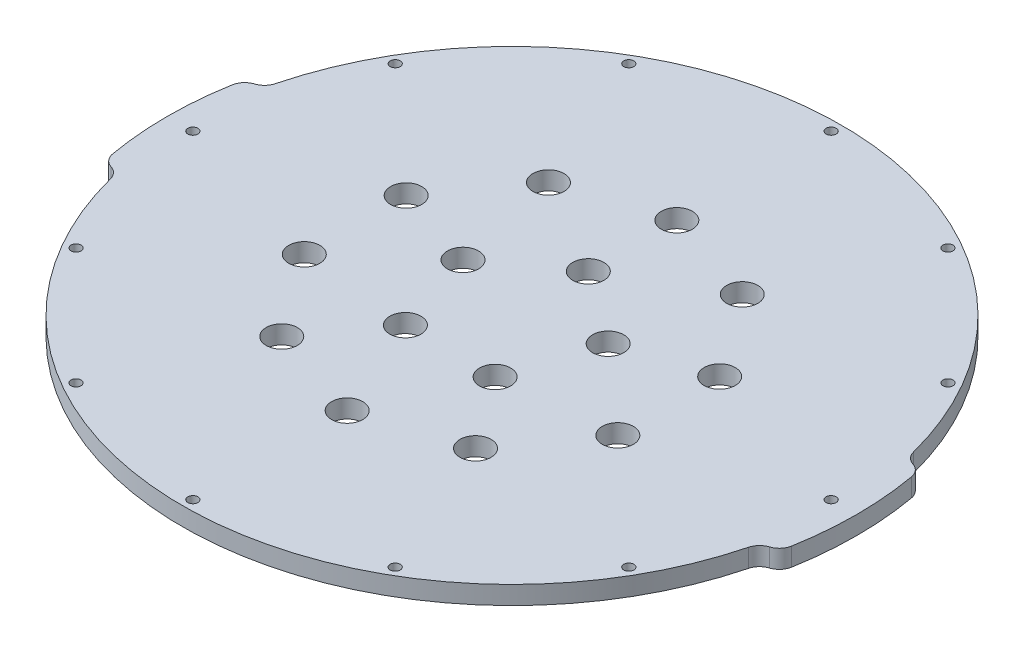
ISO-10303-21;
HEADER;
FILE_DESCRIPTION(('STEP AP214'),'2;1');
FILE_NAME('part.step','',(''),(''),'','','');
FILE_SCHEMA(('AUTOMOTIVE_DESIGN { 1 0 10303 214 1 1 1 1 }'));
ENDSEC;
DATA;
#1=APPLICATION_CONTEXT('core data for automotive mechanical design processes');
#2=APPLICATION_PROTOCOL_DEFINITION('international standard','automotive_design',2000,#1);
#3=PRODUCT_CONTEXT('',#1,'mechanical');
#4=PRODUCT('Part','Part','',(#3));
#5=PRODUCT_RELATED_PRODUCT_CATEGORY('part','',(#4));
#6=PRODUCT_DEFINITION_FORMATION('','',#4);
#7=PRODUCT_DEFINITION_CONTEXT('part definition',#1,'design');
#8=PRODUCT_DEFINITION('design','',#6,#7);
#9=PRODUCT_DEFINITION_SHAPE('','',#8);
#10=(LENGTH_UNIT() NAMED_UNIT(*) SI_UNIT(.MILLI.,.METRE.));
#11=(NAMED_UNIT(*) PLANE_ANGLE_UNIT() SI_UNIT($,.RADIAN.));
#12=(NAMED_UNIT(*) SI_UNIT($,.STERADIAN.) SOLID_ANGLE_UNIT());
#13=UNCERTAINTY_MEASURE_WITH_UNIT(LENGTH_MEASURE(1.E-05),#10,'distance_accuracy_value','');
#14=(GEOMETRIC_REPRESENTATION_CONTEXT(3) GLOBAL_UNCERTAINTY_ASSIGNED_CONTEXT((#13)) GLOBAL_UNIT_ASSIGNED_CONTEXT((#10,
#11,#12)) REPRESENTATION_CONTEXT('',''));
#15=CARTESIAN_POINT('',(0.,0.,0.));
#16=DIRECTION('',(0.,0.,1.));
#17=DIRECTION('',(1.,0.,0.));
#18=AXIS2_PLACEMENT_3D('',#15,#16,#17);
#19=CARTESIAN_POINT('',(-53.1549984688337,6.,-9.37266038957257));
#20=DIRECTION('',(0.,-1.,0.));
#21=DIRECTION('',(0.,0.,-1.));
#22=AXIS2_PLACEMENT_3D('',#19,#20,#21);
#23=PLANE('',#22);
#24=CARTESIAN_POINT('',(23.7764129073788,6.,-7.72542485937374));
#25=DIRECTION('',(0.,1.,0.));
#26=DIRECTION('',(0.,0.,1.));
#27=AXIS2_PLACEMENT_3D('',#24,#25,#26);
#28=CIRCLE('',#27,5.1);
#29=CARTESIAN_POINT('',(23.7764129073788,6.,-2.62542485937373));
#30=VERTEX_POINT('',#29);
#31=EDGE_CURVE('E273',#30,#30,#28,.T.);
#32=ORIENTED_EDGE('',*,*,#31,.F.);
#33=EDGE_LOOP('',(#32));
#34=FACE_BOUND('',#33,.T.);
#35=CARTESIAN_POINT('',(0.,6.,-25.));
#36=DIRECTION('',(0.,1.,0.));
#37=DIRECTION('',(0.,0.,1.));
#38=AXIS2_PLACEMENT_3D('',#35,#36,#37);
#39=CIRCLE('',#38,5.1);
#40=CARTESIAN_POINT('',(0.,6.,-19.9));
#41=VERTEX_POINT('',#40);
#42=EDGE_CURVE('E281',#41,#41,#39,.T.);
#43=ORIENTED_EDGE('',*,*,#42,.F.);
#44=EDGE_LOOP('',(#43));
#45=FACE_BOUND('',#44,.T.);
#46=CARTESIAN_POINT('',(-23.7764129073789,6.,-7.72542485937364));
#47=DIRECTION('',(0.,1.,0.));
#48=DIRECTION('',(0.,0.,1.));
#49=AXIS2_PLACEMENT_3D('',#46,#47,#48);
#50=CIRCLE('',#49,5.1);
#51=CARTESIAN_POINT('',(-23.7764129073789,6.,-2.62542485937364));
#52=VERTEX_POINT('',#51);
#53=EDGE_CURVE('E215',#52,#52,#50,.T.);
#54=ORIENTED_EDGE('',*,*,#53,.F.);
#55=EDGE_LOOP('',(#54));
#56=FACE_BOUND('',#55,.T.);
#57=CARTESIAN_POINT('',(-14.6946313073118,6.,20.2254248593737));
#58=DIRECTION('',(0.,1.,0.));
#59=DIRECTION('',(0.,0.,1.));
#60=AXIS2_PLACEMENT_3D('',#57,#58,#59);
#61=CIRCLE('',#60,5.1);
#62=CARTESIAN_POINT('',(-14.6946313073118,6.,25.3254248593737));
#63=VERTEX_POINT('',#62);
#64=EDGE_CURVE('E214',#63,#63,#61,.T.);
#65=ORIENTED_EDGE('',*,*,#64,.F.);
#66=EDGE_LOOP('',(#65));
#67=FACE_BOUND('',#66,.T.);
#68=CARTESIAN_POINT('',(-31.7404036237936,6.,-43.6869176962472));
#69=DIRECTION('',(0.,1.,0.));
#70=DIRECTION('',(0.,0.,1.));
#71=AXIS2_PLACEMENT_3D('',#68,#69,#70);
#72=CIRCLE('',#71,5.1);
#73=CARTESIAN_POINT('',(-31.7404036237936,6.,-38.5869176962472));
#74=VERTEX_POINT('',#73);
#75=EDGE_CURVE('E296',#74,#74,#72,.T.);
#76=ORIENTED_EDGE('',*,*,#75,.F.);
#77=EDGE_LOOP('',(#76));
#78=FACE_BOUND('',#77,.T.);
#79=CARTESIAN_POINT('',(-51.3570518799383,6.,-16.6869176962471));
#80=DIRECTION('',(0.,1.,0.));
#81=DIRECTION('',(0.,0.,1.));
#82=AXIS2_PLACEMENT_3D('',#79,#80,#81);
#83=CIRCLE('',#82,5.1);
#84=CARTESIAN_POINT('',(-51.3570518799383,6.,-11.5869176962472));
#85=VERTEX_POINT('',#84);
#86=EDGE_CURVE('E302',#85,#85,#83,.T.);
#87=ORIENTED_EDGE('',*,*,#86,.F.);
#88=EDGE_LOOP('',(#87));
#89=FACE_BOUND('',#88,.T.);
#90=CARTESIAN_POINT('',(-51.3570518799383,6.,16.6869176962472));
#91=DIRECTION('',(0.,1.,0.));
#92=DIRECTION('',(0.,0.,1.));
#93=AXIS2_PLACEMENT_3D('',#90,#91,#92);
#94=CIRCLE('',#93,5.1);
#95=CARTESIAN_POINT('',(-51.3570518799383,6.,21.7869176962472));
#96=VERTEX_POINT('',#95);
#97=EDGE_CURVE('E243',#96,#96,#94,.T.);
#98=ORIENTED_EDGE('',*,*,#97,.F.);
#99=EDGE_LOOP('',(#98));
#100=FACE_BOUND('',#99,.T.);
#101=CARTESIAN_POINT('',(-31.7404036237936,6.,43.6869176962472));
#102=DIRECTION('',(0.,1.,0.));
#103=DIRECTION('',(0.,0.,1.));
#104=AXIS2_PLACEMENT_3D('',#101,#102,#103);
#105=CIRCLE('',#104,5.1);
#106=CARTESIAN_POINT('',(-31.7404036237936,6.,48.7869176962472));
#107=VERTEX_POINT('',#106);
#108=EDGE_CURVE('E242',#107,#107,#105,.T.);
#109=ORIENTED_EDGE('',*,*,#108,.F.);
#110=EDGE_LOOP('',(#109));
#111=FACE_BOUND('',#110,.T.);
#112=CARTESIAN_POINT('',(0.,6.,54.));
#113=DIRECTION('',(0.,1.,0.));
#114=DIRECTION('',(0.,0.,1.));
#115=AXIS2_PLACEMENT_3D('',#112,#113,#114);
#116=CIRCLE('',#115,5.1);
#117=CARTESIAN_POINT('',(0.,6.,59.1));
#118=VERTEX_POINT('',#117);
#119=EDGE_CURVE('E316',#118,#118,#116,.T.);
#120=ORIENTED_EDGE('',*,*,#119,.F.);
#121=EDGE_LOOP('',(#120));
#122=FACE_BOUND('',#121,.T.);
#123=CARTESIAN_POINT('',(14.6946313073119,6.,20.2254248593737));
#124=DIRECTION('',(0.,1.,0.));
#125=DIRECTION('',(0.,0.,1.));
#126=AXIS2_PLACEMENT_3D('',#123,#124,#125);
#127=CIRCLE('',#126,5.1);
#128=CARTESIAN_POINT('',(14.6946313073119,6.,25.3254248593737));
#129=VERTEX_POINT('',#128);
#130=EDGE_CURVE('E324',#129,#129,#127,.T.);
#131=ORIENTED_EDGE('',*,*,#130,.F.);
#132=EDGE_LOOP('',(#131));
#133=FACE_BOUND('',#132,.T.);
#134=CARTESIAN_POINT('',(31.7404036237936,6.,43.6869176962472));
#135=DIRECTION('',(0.,1.,0.));
#136=DIRECTION('',(0.,0.,1.));
#137=AXIS2_PLACEMENT_3D('',#134,#135,#136);
#138=CIRCLE('',#137,5.09999999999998);
#139=CARTESIAN_POINT('',(31.7404036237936,6.,48.7869176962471));
#140=VERTEX_POINT('',#139);
#141=EDGE_CURVE('E204',#140,#140,#138,.T.);
#142=ORIENTED_EDGE('',*,*,#141,.F.);
#143=EDGE_LOOP('',(#142));
#144=FACE_BOUND('',#143,.T.);
#145=CARTESIAN_POINT('',(51.3570518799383,6.,16.6869176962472));
#146=DIRECTION('',(0.,1.,0.));
#147=DIRECTION('',(0.,0.,1.));
#148=AXIS2_PLACEMENT_3D('',#145,#146,#147);
#149=CIRCLE('',#148,5.10000000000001);
#150=CARTESIAN_POINT('',(51.3570518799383,6.,21.7869176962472));
#151=VERTEX_POINT('',#150);
#152=EDGE_CURVE('E209',#151,#151,#149,.T.);
#153=ORIENTED_EDGE('',*,*,#152,.F.);
#154=EDGE_LOOP('',(#153));
#155=FACE_BOUND('',#154,.T.);
#156=CARTESIAN_POINT('',(51.3570518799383,6.,-16.6869176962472));
#157=DIRECTION('',(0.,1.,0.));
#158=DIRECTION('',(0.,0.,1.));
#159=AXIS2_PLACEMENT_3D('',#156,#157,#158);
#160=CIRCLE('',#159,5.09999999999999);
#161=CARTESIAN_POINT('',(51.3570518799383,6.,-11.5869176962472));
#162=VERTEX_POINT('',#161);
#163=EDGE_CURVE('E237',#162,#162,#160,.T.);
#164=ORIENTED_EDGE('',*,*,#163,.F.);
#165=EDGE_LOOP('',(#164));
#166=FACE_BOUND('',#165,.T.);
#167=CARTESIAN_POINT('',(31.7404036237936,6.,-43.6869176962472));
#168=DIRECTION('',(0.,1.,0.));
#169=DIRECTION('',(0.,0.,1.));
#170=AXIS2_PLACEMENT_3D('',#167,#168,#169);
#171=CIRCLE('',#170,5.09999999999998);
#172=CARTESIAN_POINT('',(31.7404036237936,6.,-38.5869176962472));
#173=VERTEX_POINT('',#172);
#174=EDGE_CURVE('E341',#173,#173,#171,.T.);
#175=ORIENTED_EDGE('',*,*,#174,.F.);
#176=EDGE_LOOP('',(#175));
#177=FACE_BOUND('',#176,.T.);
#178=CARTESIAN_POINT('',(0.,6.,-54.));
#179=DIRECTION('',(0.,1.,0.));
#180=DIRECTION('',(0.,0.,1.));
#181=AXIS2_PLACEMENT_3D('',#178,#179,#180);
#182=CIRCLE('',#181,5.1);
#183=CARTESIAN_POINT('',(0.,6.,-48.9));
#184=VERTEX_POINT('',#183);
#185=EDGE_CURVE('E349',#184,#184,#182,.T.);
#186=ORIENTED_EDGE('',*,*,#185,.F.);
#187=EDGE_LOOP('',(#186));
#188=FACE_BOUND('',#187,.T.);
#189=CARTESIAN_POINT('',(-90.5429559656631,6.,-52.2749999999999));
#190=DIRECTION('',(0.,1.,0.));
#191=DIRECTION('',(0.,0.,1.));
#192=AXIS2_PLACEMENT_3D('',#189,#190,#191);
#193=CIRCLE('',#192,1.65000000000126);
#194=CARTESIAN_POINT('',(-90.5429559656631,6.,-50.6249999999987));
#195=VERTEX_POINT('',#194);
#196=EDGE_CURVE('E368',#195,#195,#193,.T.);
#197=ORIENTED_EDGE('',*,*,#196,.F.);
#198=EDGE_LOOP('',(#197));
#199=FACE_BOUND('',#198,.T.);
#200=CARTESIAN_POINT('',(-90.542955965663,6.,52.2750000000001));
#201=DIRECTION('',(0.,1.,0.));
#202=DIRECTION('',(0.,0.,1.));
#203=AXIS2_PLACEMENT_3D('',#200,#201,#202);
#204=CIRCLE('',#203,1.65000000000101);
#205=CARTESIAN_POINT('',(-90.542955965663,6.,53.9250000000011));
#206=VERTEX_POINT('',#205);
#207=EDGE_CURVE('E384',#206,#206,#204,.T.);
#208=ORIENTED_EDGE('',*,*,#207,.F.);
#209=EDGE_LOOP('',(#208));
#210=FACE_BOUND('',#209,.T.);
#211=CARTESIAN_POINT('',(0.,6.,104.55));
#212=DIRECTION('',(0.,1.,0.));
#213=DIRECTION('',(0.,0.,1.));
#214=AXIS2_PLACEMENT_3D('',#211,#212,#213);
#215=CIRCLE('',#214,1.65000000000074);
#216=CARTESIAN_POINT('',(0.,6.,106.200000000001));
#217=VERTEX_POINT('',#216);
#218=EDGE_CURVE('E399',#217,#217,#215,.T.);
#219=ORIENTED_EDGE('',*,*,#218,.F.);
#220=EDGE_LOOP('',(#219));
#221=FACE_BOUND('',#220,.T.);
#222=CARTESIAN_POINT('',(90.5429559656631,6.,52.275));
#223=DIRECTION('',(0.,1.,0.));
#224=DIRECTION('',(0.,0.,1.));
#225=AXIS2_PLACEMENT_3D('',#222,#223,#224);
#226=CIRCLE('',#225,1.65000000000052);
#227=CARTESIAN_POINT('',(90.5429559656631,6.,53.9250000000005));
#228=VERTEX_POINT('',#227);
#229=EDGE_CURVE('E217',#228,#228,#226,.T.);
#230=ORIENTED_EDGE('',*,*,#229,.F.);
#231=EDGE_LOOP('',(#230));
#232=FACE_BOUND('',#231,.T.);
#233=CARTESIAN_POINT('',(90.5429559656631,6.,-52.275));
#234=DIRECTION('',(0.,1.,0.));
#235=DIRECTION('',(0.,0.,1.));
#236=AXIS2_PLACEMENT_3D('',#233,#234,#235);
#237=CIRCLE('',#236,1.65000000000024);
#238=CARTESIAN_POINT('',(90.5429559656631,6.,-50.6249999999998));
#239=VERTEX_POINT('',#238);
#240=EDGE_CURVE('E417',#239,#239,#237,.T.);
#241=ORIENTED_EDGE('',*,*,#240,.F.);
#242=EDGE_LOOP('',(#241));
#243=FACE_BOUND('',#242,.T.);
#244=CARTESIAN_POINT('',(0.,6.,-104.55));
#245=DIRECTION('',(0.,1.,0.));
#246=DIRECTION('',(0.,0.,1.));
#247=AXIS2_PLACEMENT_3D('',#244,#245,#246);
#248=CIRCLE('',#247,1.65);
#249=CARTESIAN_POINT('',(0.,6.,-102.9));
#250=VERTEX_POINT('',#249);
#251=EDGE_CURVE('E433',#250,#250,#248,.T.);
#252=ORIENTED_EDGE('',*,*,#251,.F.);
#253=EDGE_LOOP('',(#252));
#254=FACE_BOUND('',#253,.T.);
#255=CARTESIAN_POINT('',(0.,6.,0.));
#256=DIRECTION('',(0.,1.,0.));
#257=DIRECTION('',(0.,0.,-1.));
#258=AXIS2_PLACEMENT_3D('',#255,#256,#257);
#259=CIRCLE('',#258,107.95);
#260=CARTESIAN_POINT('',(104.513991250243,6.,-27.0190327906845));
#261=VERTEX_POINT('',#260);
#262=CARTESIAN_POINT('',(-104.513991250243,6.,-27.0190327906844));
#263=VERTEX_POINT('',#262);
#264=EDGE_CURVE('E255',#261,#263,#259,.T.);
#265=ORIENTED_EDGE('',*,*,#264,.T.);
#266=CARTESIAN_POINT('',(-109.354843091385,6.,-28.2704933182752));
#267=DIRECTION('',(0.,-1.,0.));
#268=DIRECTION('',(0.,0.,-1.));
#269=AXIS2_PLACEMENT_3D('',#266,#267,#268);
#270=CIRCLE('',#269,5.);
#271=CARTESIAN_POINT('',(-107.832420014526,6.,-23.5079070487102));
#272=VERTEX_POINT('',#271);
#273=EDGE_CURVE('E130',#263,#272,#270,.T.);
#274=ORIENTED_EDGE('',*,*,#273,.T.);
#275=CARTESIAN_POINT('',(-106.309996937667,6.,-18.7453207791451));
#276=DIRECTION('',(0.,1.,0.));
#277=DIRECTION('',(0.,0.,-1.));
#278=AXIS2_PLACEMENT_3D('',#275,#276,#277);
#279=CIRCLE('',#278,5.00000000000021);
#280=CARTESIAN_POINT('',(-111.234035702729,6.,-19.6135616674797));
#281=VERTEX_POINT('',#280);
#282=EDGE_CURVE('E123',#272,#281,#279,.T.);
#283=ORIENTED_EDGE('',*,*,#282,.T.);
#284=CARTESIAN_POINT('',(0.,6.,0.));
#285=DIRECTION('',(0.,1.,0.));
#286=DIRECTION('',(0.,0.,-1.));
#287=AXIS2_PLACEMENT_3D('',#284,#285,#286);
#288=CIRCLE('',#287,112.95);
#289=CARTESIAN_POINT('',(-111.234035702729,6.,19.6135616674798));
#290=VERTEX_POINT('',#289);
#291=EDGE_CURVE('E127',#281,#290,#288,.T.);
#292=ORIENTED_EDGE('',*,*,#291,.T.);
#293=CARTESIAN_POINT('',(-106.309996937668,6.,18.7453207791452));
#294=DIRECTION('',(0.,1.,0.));
#295=DIRECTION('',(0.,0.,1.));
#296=AXIS2_PLACEMENT_3D('',#293,#294,#295);
#297=CIRCLE('',#296,5.00000000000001);
#298=CARTESIAN_POINT('',(-107.832420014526,6.,23.5079070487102));
#299=VERTEX_POINT('',#298);
#300=EDGE_CURVE('E145',#290,#299,#297,.T.);
#301=ORIENTED_EDGE('',*,*,#300,.T.);
#302=CARTESIAN_POINT('',(-109.354843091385,6.,28.2704933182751));
#303=DIRECTION('',(0.,-1.,0.));
#304=DIRECTION('',(0.,0.,-1.));
#305=AXIS2_PLACEMENT_3D('',#302,#303,#304);
#306=CIRCLE('',#305,5.);
#307=CARTESIAN_POINT('',(-104.513991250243,6.,27.0190327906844));
#308=VERTEX_POINT('',#307);
#309=EDGE_CURVE('E11',#299,#308,#306,.T.);
#310=ORIENTED_EDGE('',*,*,#309,.T.);
#311=CARTESIAN_POINT('',(0.,6.,-4.92661467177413E-13));
#312=DIRECTION('',(0.,1.,0.));
#313=DIRECTION('',(0.,0.,-1.));
#314=AXIS2_PLACEMENT_3D('',#311,#312,#313);
#315=CIRCLE('',#314,107.95);
#316=CARTESIAN_POINT('',(104.513991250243,6.,27.0190327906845));
#317=VERTEX_POINT('',#316);
#318=EDGE_CURVE('E247',#308,#317,#315,.T.);
#319=ORIENTED_EDGE('',*,*,#318,.T.);
#320=CARTESIAN_POINT('',(109.354843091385,6.,28.2704933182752));
#321=DIRECTION('',(0.,-1.,0.));
#322=DIRECTION('',(0.,0.,-1.));
#323=AXIS2_PLACEMENT_3D('',#320,#321,#322);
#324=CIRCLE('',#323,5.);
#325=CARTESIAN_POINT('',(107.832420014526,6.,23.5079070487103));
#326=VERTEX_POINT('',#325);
#327=EDGE_CURVE('E188',#317,#326,#324,.T.);
#328=ORIENTED_EDGE('',*,*,#327,.T.);
#329=CARTESIAN_POINT('',(106.309996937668,6.,18.7453207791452));
#330=DIRECTION('',(0.,1.,0.));
#331=DIRECTION('',(0.,0.,-1.));
#332=AXIS2_PLACEMENT_3D('',#329,#330,#331);
#333=CIRCLE('',#332,5.00000000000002);
#334=CARTESIAN_POINT('',(111.234035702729,6.,19.6135616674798));
#335=VERTEX_POINT('',#334);
#336=EDGE_CURVE('E245',#326,#335,#333,.T.);
#337=ORIENTED_EDGE('',*,*,#336,.T.);
#338=CARTESIAN_POINT('',(-1.29063426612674E-12,6.,0.));
#339=DIRECTION('',(0.,1.,0.));
#340=DIRECTION('',(0.,0.,1.));
#341=AXIS2_PLACEMENT_3D('',#338,#339,#340);
#342=CIRCLE('',#341,112.950000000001);
#343=CARTESIAN_POINT('',(111.234035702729,6.,-19.6135616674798));
#344=VERTEX_POINT('',#343);
#345=EDGE_CURVE('E246',#335,#344,#342,.T.);
#346=ORIENTED_EDGE('',*,*,#345,.T.);
#347=CARTESIAN_POINT('',(106.309996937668,6.,-18.7453207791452));
#348=DIRECTION('',(0.,1.,0.));
#349=DIRECTION('',(0.,0.,1.));
#350=AXIS2_PLACEMENT_3D('',#347,#348,#349);
#351=CIRCLE('',#350,5.);
#352=CARTESIAN_POINT('',(107.832420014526,6.,-23.5079070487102));
#353=VERTEX_POINT('',#352);
#354=EDGE_CURVE('E444',#344,#353,#351,.T.);
#355=ORIENTED_EDGE('',*,*,#354,.T.);
#356=CARTESIAN_POINT('',(109.354843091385,6.,-28.2704933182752));
#357=DIRECTION('',(0.,-1.,0.));
#358=DIRECTION('',(0.,0.,-1.));
#359=AXIS2_PLACEMENT_3D('',#356,#357,#358);
#360=CIRCLE('',#359,5.);
#361=EDGE_CURVE('E194',#353,#261,#360,.T.);
#362=ORIENTED_EDGE('',*,*,#361,.T.);
#363=EDGE_LOOP('',(#265,#274,#283,#292,#301,#310,#319,#328,#337,#346,#355,#362));
#364=FACE_BOUND('',#363,.T.);
#365=CARTESIAN_POINT('',(52.275,6.,-90.5429559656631));
#366=DIRECTION('',(0.,1.,0.));
#367=DIRECTION('',(0.,0.,1.));
#368=AXIS2_PLACEMENT_3D('',#365,#366,#367);
#369=CIRCLE('',#368,1.65000000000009);
#370=CARTESIAN_POINT('',(52.275,6.,-88.892955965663));
#371=VERTEX_POINT('',#370);
#372=EDGE_CURVE('E425',#371,#371,#369,.T.);
#373=ORIENTED_EDGE('',*,*,#372,.F.);
#374=EDGE_LOOP('',(#373));
#375=FACE_BOUND('',#374,.T.);
#376=CARTESIAN_POINT('',(104.55,6.,0.));
#377=DIRECTION('',(0.,1.,0.));
#378=DIRECTION('',(0.,0.,1.));
#379=AXIS2_PLACEMENT_3D('',#376,#377,#378);
#380=CIRCLE('',#379,1.65000000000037);
#381=CARTESIAN_POINT('',(104.55,6.,1.65000000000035));
#382=VERTEX_POINT('',#381);
#383=EDGE_CURVE('E260',#382,#382,#380,.T.);
#384=ORIENTED_EDGE('',*,*,#383,.F.);
#385=EDGE_LOOP('',(#384));
#386=FACE_BOUND('',#385,.T.);
#387=CARTESIAN_POINT('',(52.2750000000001,6.,90.542955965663));
#388=DIRECTION('',(0.,1.,0.));
#389=DIRECTION('',(0.,0.,1.));
#390=AXIS2_PLACEMENT_3D('',#387,#388,#389);
#391=CIRCLE('',#390,1.65000000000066);
#392=CARTESIAN_POINT('',(52.2750000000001,6.,92.1929559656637));
#393=VERTEX_POINT('',#392);
#394=EDGE_CURVE('E407',#393,#393,#391,.T.);
#395=ORIENTED_EDGE('',*,*,#394,.F.);
#396=EDGE_LOOP('',(#395));
#397=FACE_BOUND('',#396,.T.);
#398=CARTESIAN_POINT('',(-52.2749999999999,6.,90.5429559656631));
#399=DIRECTION('',(0.,1.,0.));
#400=DIRECTION('',(0.,0.,1.));
#401=AXIS2_PLACEMENT_3D('',#398,#399,#400);
#402=CIRCLE('',#401,1.65000000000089);
#403=CARTESIAN_POINT('',(-52.2749999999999,6.,92.192955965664));
#404=VERTEX_POINT('',#403);
#405=EDGE_CURVE('E392',#404,#404,#402,.T.);
#406=ORIENTED_EDGE('',*,*,#405,.F.);
#407=EDGE_LOOP('',(#406));
#408=FACE_BOUND('',#407,.T.);
#409=CARTESIAN_POINT('',(-104.55,6.,0.));
#410=DIRECTION('',(0.,1.,0.));
#411=DIRECTION('',(0.,0.,1.));
#412=AXIS2_PLACEMENT_3D('',#409,#410,#411);
#413=CIRCLE('',#412,1.65000000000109);
#414=CARTESIAN_POINT('',(-104.55,6.,1.65000000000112));
#415=VERTEX_POINT('',#414);
#416=EDGE_CURVE('E376',#415,#415,#413,.T.);
#417=ORIENTED_EDGE('',*,*,#416,.F.);
#418=EDGE_LOOP('',(#417));
#419=FACE_BOUND('',#418,.T.);
#420=CARTESIAN_POINT('',(-52.275,6.,-90.542955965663));
#421=DIRECTION('',(0.,1.,0.));
#422=DIRECTION('',(0.,0.,1.));
#423=AXIS2_PLACEMENT_3D('',#420,#421,#422);
#424=CIRCLE('',#423,1.65000000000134);
#425=CARTESIAN_POINT('',(-52.275,6.,-88.8929559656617));
#426=VERTEX_POINT('',#425);
#427=EDGE_CURVE('E360',#426,#426,#424,.T.);
#428=ORIENTED_EDGE('',*,*,#427,.F.);
#429=EDGE_LOOP('',(#428));
#430=FACE_BOUND('',#429,.T.);
#431=ADVANCED_FACE('F34',(#34,#45,#56,#67,#78,#89,#100,#111,#122,#133,#144,#155,#166,#177,#188,
#199,#210,#221,#232,#243,#254,#364,#375,#386,#397,#408,#419,#430),#23,.F.);
#432=CARTESIAN_POINT('',(-53.1549984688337,0.,-9.37266038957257));
#433=DIRECTION('',(0.,-1.,0.));
#434=DIRECTION('',(0.,0.,-1.));
#435=AXIS2_PLACEMENT_3D('',#432,#433,#434);
#436=PLANE('',#435);
#437=CARTESIAN_POINT('',(23.7764129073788,0.,-7.72542485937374));
#438=DIRECTION('',(0.,1.,0.));
#439=DIRECTION('',(0.,0.,1.));
#440=AXIS2_PLACEMENT_3D('',#437,#438,#439);
#441=CIRCLE('',#440,5.1);
#442=CARTESIAN_POINT('',(23.7764129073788,0.,-2.62542485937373));
#443=VERTEX_POINT('',#442);
#444=EDGE_CURVE('E275',#443,#443,#441,.T.);
#445=ORIENTED_EDGE('',*,*,#444,.T.);
#446=EDGE_LOOP('',(#445));
#447=FACE_BOUND('',#446,.T.);
#448=CARTESIAN_POINT('',(0.,0.,-25.));
#449=DIRECTION('',(0.,1.,0.));
#450=DIRECTION('',(0.,0.,1.));
#451=AXIS2_PLACEMENT_3D('',#448,#449,#450);
#452=CIRCLE('',#451,5.1);
#453=CARTESIAN_POINT('',(0.,0.,-19.9));
#454=VERTEX_POINT('',#453);
#455=EDGE_CURVE('E284',#454,#454,#452,.T.);
#456=ORIENTED_EDGE('',*,*,#455,.T.);
#457=EDGE_LOOP('',(#456));
#458=FACE_BOUND('',#457,.T.);
#459=CARTESIAN_POINT('',(-23.7764129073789,0.,-7.72542485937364));
#460=DIRECTION('',(0.,1.,0.));
#461=DIRECTION('',(0.,0.,1.));
#462=AXIS2_PLACEMENT_3D('',#459,#460,#461);
#463=CIRCLE('',#462,5.1);
#464=CARTESIAN_POINT('',(-23.7764129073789,0.,-2.62542485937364));
#465=VERTEX_POINT('',#464);
#466=EDGE_CURVE('E211',#465,#465,#463,.T.);
#467=ORIENTED_EDGE('',*,*,#466,.T.);
#468=EDGE_LOOP('',(#467));
#469=FACE_BOUND('',#468,.T.);
#470=CARTESIAN_POINT('',(-14.6946313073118,0.,20.2254248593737));
#471=DIRECTION('',(0.,1.,0.));
#472=DIRECTION('',(0.,0.,1.));
#473=AXIS2_PLACEMENT_3D('',#470,#471,#472);
#474=CIRCLE('',#473,5.1);
#475=CARTESIAN_POINT('',(-14.6946313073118,0.,25.3254248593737));
#476=VERTEX_POINT('',#475);
#477=EDGE_CURVE('E252',#476,#476,#474,.T.);
#478=ORIENTED_EDGE('',*,*,#477,.T.);
#479=EDGE_LOOP('',(#478));
#480=FACE_BOUND('',#479,.T.);
#481=CARTESIAN_POINT('',(-31.7404036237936,0.,-43.6869176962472));
#482=DIRECTION('',(0.,1.,0.));
#483=DIRECTION('',(0.,0.,1.));
#484=AXIS2_PLACEMENT_3D('',#481,#482,#483);
#485=CIRCLE('',#484,5.1);
#486=CARTESIAN_POINT('',(-31.7404036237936,0.,-38.5869176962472));
#487=VERTEX_POINT('',#486);
#488=EDGE_CURVE('E298',#487,#487,#485,.T.);
#489=ORIENTED_EDGE('',*,*,#488,.T.);
#490=EDGE_LOOP('',(#489));
#491=FACE_BOUND('',#490,.T.);
#492=CARTESIAN_POINT('',(-51.3570518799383,0.,-16.6869176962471));
#493=DIRECTION('',(0.,1.,0.));
#494=DIRECTION('',(0.,0.,1.));
#495=AXIS2_PLACEMENT_3D('',#492,#493,#494);
#496=CIRCLE('',#495,5.1);
#497=CARTESIAN_POINT('',(-51.3570518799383,0.,-11.5869176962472));
#498=VERTEX_POINT('',#497);
#499=EDGE_CURVE('E271',#498,#498,#496,.T.);
#500=ORIENTED_EDGE('',*,*,#499,.T.);
#501=EDGE_LOOP('',(#500));
#502=FACE_BOUND('',#501,.T.);
#503=CARTESIAN_POINT('',(-51.3570518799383,0.,16.6869176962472));
#504=DIRECTION('',(0.,1.,0.));
#505=DIRECTION('',(0.,0.,1.));
#506=AXIS2_PLACEMENT_3D('',#503,#504,#505);
#507=CIRCLE('',#506,5.1);
#508=CARTESIAN_POINT('',(-51.3570518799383,0.,21.7869176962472));
#509=VERTEX_POINT('',#508);
#510=EDGE_CURVE('E239',#509,#509,#507,.T.);
#511=ORIENTED_EDGE('',*,*,#510,.T.);
#512=EDGE_LOOP('',(#511));
#513=FACE_BOUND('',#512,.T.);
#514=CARTESIAN_POINT('',(-31.7404036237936,0.,43.6869176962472));
#515=DIRECTION('',(0.,1.,0.));
#516=DIRECTION('',(0.,0.,1.));
#517=AXIS2_PLACEMENT_3D('',#514,#515,#516);
#518=CIRCLE('',#517,5.1);
#519=CARTESIAN_POINT('',(-31.7404036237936,0.,48.7869176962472));
#520=VERTEX_POINT('',#519);
#521=EDGE_CURVE('E312',#520,#520,#518,.T.);
#522=ORIENTED_EDGE('',*,*,#521,.T.);
#523=EDGE_LOOP('',(#522));
#524=FACE_BOUND('',#523,.T.);
#525=CARTESIAN_POINT('',(0.,0.,54.));
#526=DIRECTION('',(0.,1.,0.));
#527=DIRECTION('',(0.,0.,1.));
#528=AXIS2_PLACEMENT_3D('',#525,#526,#527);
#529=CIRCLE('',#528,5.1);
#530=CARTESIAN_POINT('',(0.,0.,59.1));
#531=VERTEX_POINT('',#530);
#532=EDGE_CURVE('E320',#531,#531,#529,.T.);
#533=ORIENTED_EDGE('',*,*,#532,.T.);
#534=EDGE_LOOP('',(#533));
#535=FACE_BOUND('',#534,.T.);
#536=CARTESIAN_POINT('',(14.6946313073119,0.,20.2254248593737));
#537=DIRECTION('',(0.,1.,0.));
#538=DIRECTION('',(0.,0.,1.));
#539=AXIS2_PLACEMENT_3D('',#536,#537,#538);
#540=CIRCLE('',#539,5.1);
#541=CARTESIAN_POINT('',(14.6946313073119,0.,25.3254248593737));
#542=VERTEX_POINT('',#541);
#543=EDGE_CURVE('E328',#542,#542,#540,.T.);
#544=ORIENTED_EDGE('',*,*,#543,.T.);
#545=EDGE_LOOP('',(#544));
#546=FACE_BOUND('',#545,.T.);
#547=CARTESIAN_POINT('',(31.7404036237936,0.,43.6869176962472));
#548=DIRECTION('',(0.,1.,0.));
#549=DIRECTION('',(0.,0.,1.));
#550=AXIS2_PLACEMENT_3D('',#547,#548,#549);
#551=CIRCLE('',#550,5.09999999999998);
#552=CARTESIAN_POINT('',(31.7404036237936,0.,48.7869176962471));
#553=VERTEX_POINT('',#552);
#554=EDGE_CURVE('E206',#553,#553,#551,.T.);
#555=ORIENTED_EDGE('',*,*,#554,.T.);
#556=EDGE_LOOP('',(#555));
#557=FACE_BOUND('',#556,.T.);
#558=CARTESIAN_POINT('',(51.3570518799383,0.,16.6869176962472));
#559=DIRECTION('',(0.,1.,0.));
#560=DIRECTION('',(0.,0.,1.));
#561=AXIS2_PLACEMENT_3D('',#558,#559,#560);
#562=CIRCLE('',#561,5.10000000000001);
#563=CARTESIAN_POINT('',(51.3570518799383,0.,21.7869176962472));
#564=VERTEX_POINT('',#563);
#565=EDGE_CURVE('E225',#564,#564,#562,.T.);
#566=ORIENTED_EDGE('',*,*,#565,.T.);
#567=EDGE_LOOP('',(#566));
#568=FACE_BOUND('',#567,.T.);
#569=CARTESIAN_POINT('',(51.3570518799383,0.,-16.6869176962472));
#570=DIRECTION('',(0.,1.,0.));
#571=DIRECTION('',(0.,0.,1.));
#572=AXIS2_PLACEMENT_3D('',#569,#570,#571);
#573=CIRCLE('',#572,5.09999999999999);
#574=CARTESIAN_POINT('',(51.3570518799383,0.,-11.5869176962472));
#575=VERTEX_POINT('',#574);
#576=EDGE_CURVE('E337',#575,#575,#573,.T.);
#577=ORIENTED_EDGE('',*,*,#576,.T.);
#578=EDGE_LOOP('',(#577));
#579=FACE_BOUND('',#578,.T.);
#580=CARTESIAN_POINT('',(31.7404036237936,0.,-43.6869176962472));
#581=DIRECTION('',(0.,1.,0.));
#582=DIRECTION('',(0.,0.,1.));
#583=AXIS2_PLACEMENT_3D('',#580,#581,#582);
#584=CIRCLE('',#583,5.09999999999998);
#585=CARTESIAN_POINT('',(31.7404036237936,0.,-38.5869176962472));
#586=VERTEX_POINT('',#585);
#587=EDGE_CURVE('E345',#586,#586,#584,.T.);
#588=ORIENTED_EDGE('',*,*,#587,.T.);
#589=EDGE_LOOP('',(#588));
#590=FACE_BOUND('',#589,.T.);
#591=CARTESIAN_POINT('',(0.,0.,-54.));
#592=DIRECTION('',(0.,1.,0.));
#593=DIRECTION('',(0.,0.,1.));
#594=AXIS2_PLACEMENT_3D('',#591,#592,#593);
#595=CIRCLE('',#594,5.1);
#596=CARTESIAN_POINT('',(0.,0.,-48.9));
#597=VERTEX_POINT('',#596);
#598=EDGE_CURVE('E352',#597,#597,#595,.T.);
#599=ORIENTED_EDGE('',*,*,#598,.T.);
#600=EDGE_LOOP('',(#599));
#601=FACE_BOUND('',#600,.T.);
#602=CARTESIAN_POINT('',(-90.5429559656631,0.,-52.2749999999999));
#603=DIRECTION('',(0.,1.,0.));
#604=DIRECTION('',(0.,0.,1.));
#605=AXIS2_PLACEMENT_3D('',#602,#603,#604);
#606=CIRCLE('',#605,1.65000000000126);
#607=CARTESIAN_POINT('',(-90.5429559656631,0.,-50.6249999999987));
#608=VERTEX_POINT('',#607);
#609=EDGE_CURVE('E364',#608,#608,#606,.T.);
#610=ORIENTED_EDGE('',*,*,#609,.T.);
#611=EDGE_LOOP('',(#610));
#612=FACE_BOUND('',#611,.T.);
#613=CARTESIAN_POINT('',(-90.542955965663,0.,52.2750000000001));
#614=DIRECTION('',(0.,1.,0.));
#615=DIRECTION('',(0.,0.,1.));
#616=AXIS2_PLACEMENT_3D('',#613,#614,#615);
#617=CIRCLE('',#616,1.65000000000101);
#618=CARTESIAN_POINT('',(-90.542955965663,0.,53.9250000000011));
#619=VERTEX_POINT('',#618);
#620=EDGE_CURVE('E380',#619,#619,#617,.T.);
#621=ORIENTED_EDGE('',*,*,#620,.T.);
#622=EDGE_LOOP('',(#621));
#623=FACE_BOUND('',#622,.T.);
#624=CARTESIAN_POINT('',(0.,0.,104.55));
#625=DIRECTION('',(0.,1.,0.));
#626=DIRECTION('',(0.,0.,1.));
#627=AXIS2_PLACEMENT_3D('',#624,#625,#626);
#628=CIRCLE('',#627,1.65000000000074);
#629=CARTESIAN_POINT('',(0.,0.,106.200000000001));
#630=VERTEX_POINT('',#629);
#631=EDGE_CURVE('E396',#630,#630,#628,.T.);
#632=ORIENTED_EDGE('',*,*,#631,.T.);
#633=EDGE_LOOP('',(#632));
#634=FACE_BOUND('',#633,.T.);
#635=CARTESIAN_POINT('',(90.5429559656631,0.,52.275));
#636=DIRECTION('',(0.,1.,0.));
#637=DIRECTION('',(0.,0.,1.));
#638=AXIS2_PLACEMENT_3D('',#635,#636,#637);
#639=CIRCLE('',#638,1.65000000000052);
#640=CARTESIAN_POINT('',(90.5429559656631,0.,53.9250000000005));
#641=VERTEX_POINT('',#640);
#642=EDGE_CURVE('E221',#641,#641,#639,.T.);
#643=ORIENTED_EDGE('',*,*,#642,.T.);
#644=EDGE_LOOP('',(#643));
#645=FACE_BOUND('',#644,.T.);
#646=CARTESIAN_POINT('',(90.5429559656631,0.,-52.275));
#647=DIRECTION('',(0.,1.,0.));
#648=DIRECTION('',(0.,0.,1.));
#649=AXIS2_PLACEMENT_3D('',#646,#647,#648);
#650=CIRCLE('',#649,1.65000000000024);
#651=CARTESIAN_POINT('',(90.5429559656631,0.,-50.6249999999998));
#652=VERTEX_POINT('',#651);
#653=EDGE_CURVE('E264',#652,#652,#650,.T.);
#654=ORIENTED_EDGE('',*,*,#653,.T.);
#655=EDGE_LOOP('',(#654));
#656=FACE_BOUND('',#655,.T.);
#657=CARTESIAN_POINT('',(0.,0.,-104.55));
#658=DIRECTION('',(0.,1.,0.));
#659=DIRECTION('',(0.,0.,1.));
#660=AXIS2_PLACEMENT_3D('',#657,#658,#659);
#661=CIRCLE('',#660,1.65);
#662=CARTESIAN_POINT('',(0.,0.,-102.9));
#663=VERTEX_POINT('',#662);
#664=EDGE_CURVE('E429',#663,#663,#661,.T.);
#665=ORIENTED_EDGE('',*,*,#664,.T.);
#666=EDGE_LOOP('',(#665));
#667=FACE_BOUND('',#666,.T.);
#668=CARTESIAN_POINT('',(-106.309996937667,0.,-18.7453207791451));
#669=DIRECTION('',(0.,1.,0.));
#670=DIRECTION('',(0.,0.,-1.));
#671=AXIS2_PLACEMENT_3D('',#668,#669,#670);
#672=CIRCLE('',#671,5.00000000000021);
#673=CARTESIAN_POINT('',(-107.832420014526,0.,-23.5079070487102));
#674=VERTEX_POINT('',#673);
#675=CARTESIAN_POINT('',(-111.234035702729,0.,-19.6135616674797));
#676=VERTEX_POINT('',#675);
#677=EDGE_CURVE('E149',#674,#676,#672,.T.);
#678=ORIENTED_EDGE('',*,*,#677,.F.);
#679=CARTESIAN_POINT('',(-109.354843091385,0.,-28.2704933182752));
#680=DIRECTION('',(0.,-1.,0.));
#681=DIRECTION('',(0.,0.,-1.));
#682=AXIS2_PLACEMENT_3D('',#679,#680,#681);
#683=CIRCLE('',#682,5.);
#684=CARTESIAN_POINT('',(-104.513991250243,0.,-27.0190327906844));
#685=VERTEX_POINT('',#684);
#686=EDGE_CURVE('E197',#674,#685,#683,.F.);
#687=ORIENTED_EDGE('',*,*,#686,.T.);
#688=CARTESIAN_POINT('',(0.,0.,0.));
#689=DIRECTION('',(0.,1.,0.));
#690=DIRECTION('',(0.,0.,-1.));
#691=AXIS2_PLACEMENT_3D('',#688,#689,#690);
#692=CIRCLE('',#691,107.95);
#693=CARTESIAN_POINT('',(104.513991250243,0.,-27.0190327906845));
#694=VERTEX_POINT('',#693);
#695=EDGE_CURVE('E136',#694,#685,#692,.T.);
#696=ORIENTED_EDGE('',*,*,#695,.F.);
#697=CARTESIAN_POINT('',(109.354843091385,0.,-28.2704933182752));
#698=DIRECTION('',(0.,-1.,0.));
#699=DIRECTION('',(0.,0.,-1.));
#700=AXIS2_PLACEMENT_3D('',#697,#698,#699);
#701=CIRCLE('',#700,5.);
#702=CARTESIAN_POINT('',(107.832420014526,0.,-23.5079070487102));
#703=VERTEX_POINT('',#702);
#704=EDGE_CURVE('E191',#694,#703,#701,.F.);
#705=ORIENTED_EDGE('',*,*,#704,.T.);
#706=CARTESIAN_POINT('',(106.309996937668,0.,-18.7453207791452));
#707=DIRECTION('',(0.,1.,0.));
#708=DIRECTION('',(0.,0.,1.));
#709=AXIS2_PLACEMENT_3D('',#706,#707,#708);
#710=CIRCLE('',#709,5.);
#711=CARTESIAN_POINT('',(111.234035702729,0.,-19.6135616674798));
#712=VERTEX_POINT('',#711);
#713=EDGE_CURVE('E463',#712,#703,#710,.T.);
#714=ORIENTED_EDGE('',*,*,#713,.F.);
#715=CARTESIAN_POINT('',(-1.29063426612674E-12,0.,0.));
#716=DIRECTION('',(0.,1.,0.));
#717=DIRECTION('',(0.,0.,1.));
#718=AXIS2_PLACEMENT_3D('',#715,#716,#717);
#719=CIRCLE('',#718,112.950000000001);
#720=CARTESIAN_POINT('',(111.234035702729,0.,19.6135616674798));
#721=VERTEX_POINT('',#720);
#722=EDGE_CURVE('E232',#721,#712,#719,.T.);
#723=ORIENTED_EDGE('',*,*,#722,.F.);
#724=CARTESIAN_POINT('',(106.309996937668,0.,18.7453207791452));
#725=DIRECTION('',(0.,1.,0.));
#726=DIRECTION('',(0.,0.,-1.));
#727=AXIS2_PLACEMENT_3D('',#724,#725,#726);
#728=CIRCLE('',#727,5.00000000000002);
#729=CARTESIAN_POINT('',(107.832420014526,0.,23.5079070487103));
#730=VERTEX_POINT('',#729);
#731=EDGE_CURVE('E230',#730,#721,#728,.T.);
#732=ORIENTED_EDGE('',*,*,#731,.F.);
#733=CARTESIAN_POINT('',(109.354843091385,0.,28.2704933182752));
#734=DIRECTION('',(0.,-1.,0.));
#735=DIRECTION('',(0.,0.,-1.));
#736=AXIS2_PLACEMENT_3D('',#733,#734,#735);
#737=CIRCLE('',#736,5.);
#738=CARTESIAN_POINT('',(104.513991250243,0.,27.0190327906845));
#739=VERTEX_POINT('',#738);
#740=EDGE_CURVE('E185',#730,#739,#737,.F.);
#741=ORIENTED_EDGE('',*,*,#740,.T.);
#742=CARTESIAN_POINT('',(0.,0.,-4.92661467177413E-13));
#743=DIRECTION('',(0.,1.,0.));
#744=DIRECTION('',(0.,0.,-1.));
#745=AXIS2_PLACEMENT_3D('',#742,#743,#744);
#746=CIRCLE('',#745,107.95);
#747=CARTESIAN_POINT('',(-104.513991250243,0.,27.0190327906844));
#748=VERTEX_POINT('',#747);
#749=EDGE_CURVE('E233',#748,#739,#746,.T.);
#750=ORIENTED_EDGE('',*,*,#749,.F.);
#751=CARTESIAN_POINT('',(-109.354843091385,0.,28.2704933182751));
#752=DIRECTION('',(0.,-1.,0.));
#753=DIRECTION('',(0.,0.,-1.));
#754=AXIS2_PLACEMENT_3D('',#751,#752,#753);
#755=CIRCLE('',#754,5.);
#756=CARTESIAN_POINT('',(-107.832420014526,0.,23.5079070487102));
#757=VERTEX_POINT('',#756);
#758=EDGE_CURVE('E43',#748,#757,#755,.F.);
#759=ORIENTED_EDGE('',*,*,#758,.T.);
#760=CARTESIAN_POINT('',(-106.309996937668,0.,18.7453207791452));
#761=DIRECTION('',(0.,1.,0.));
#762=DIRECTION('',(0.,0.,1.));
#763=AXIS2_PLACEMENT_3D('',#760,#761,#762);
#764=CIRCLE('',#763,5.00000000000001);
#765=CARTESIAN_POINT('',(-111.234035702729,0.,19.6135616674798));
#766=VERTEX_POINT('',#765);
#767=EDGE_CURVE('E455',#766,#757,#764,.T.);
#768=ORIENTED_EDGE('',*,*,#767,.F.);
#769=CARTESIAN_POINT('',(0.,0.,0.));
#770=DIRECTION('',(0.,1.,0.));
#771=DIRECTION('',(0.,0.,-1.));
#772=AXIS2_PLACEMENT_3D('',#769,#770,#771);
#773=CIRCLE('',#772,112.95);
#774=EDGE_CURVE('E452',#676,#766,#773,.T.);
#775=ORIENTED_EDGE('',*,*,#774,.F.);
#776=EDGE_LOOP('',(#678,#687,#696,#705,#714,#723,#732,#741,#750,#759,#768,#775));
#777=FACE_BOUND('',#776,.T.);
#778=CARTESIAN_POINT('',(52.275,0.,-90.5429559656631));
#779=DIRECTION('',(0.,1.,0.));
#780=DIRECTION('',(0.,0.,1.));
#781=AXIS2_PLACEMENT_3D('',#778,#779,#780);
#782=CIRCLE('',#781,1.65000000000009);
#783=CARTESIAN_POINT('',(52.275,0.,-88.892955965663));
#784=VERTEX_POINT('',#783);
#785=EDGE_CURVE('E421',#784,#784,#782,.T.);
#786=ORIENTED_EDGE('',*,*,#785,.T.);
#787=EDGE_LOOP('',(#786));
#788=FACE_BOUND('',#787,.T.);
#789=CARTESIAN_POINT('',(104.55,0.,0.));
#790=DIRECTION('',(0.,1.,0.));
#791=DIRECTION('',(0.,0.,1.));
#792=AXIS2_PLACEMENT_3D('',#789,#790,#791);
#793=CIRCLE('',#792,1.65000000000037);
#794=CARTESIAN_POINT('',(104.55,0.,1.65000000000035));
#795=VERTEX_POINT('',#794);
#796=EDGE_CURVE('E220',#795,#795,#793,.T.);
#797=ORIENTED_EDGE('',*,*,#796,.T.);
#798=EDGE_LOOP('',(#797));
#799=FACE_BOUND('',#798,.T.);
#800=CARTESIAN_POINT('',(52.2750000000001,0.,90.542955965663));
#801=DIRECTION('',(0.,1.,0.));
#802=DIRECTION('',(0.,0.,1.));
#803=AXIS2_PLACEMENT_3D('',#800,#801,#802);
#804=CIRCLE('',#803,1.65000000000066);
#805=CARTESIAN_POINT('',(52.2750000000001,0.,92.1929559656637));
#806=VERTEX_POINT('',#805);
#807=EDGE_CURVE('E403',#806,#806,#804,.T.);
#808=ORIENTED_EDGE('',*,*,#807,.T.);
#809=EDGE_LOOP('',(#808));
#810=FACE_BOUND('',#809,.T.);
#811=CARTESIAN_POINT('',(-52.2749999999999,0.,90.5429559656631));
#812=DIRECTION('',(0.,1.,0.));
#813=DIRECTION('',(0.,0.,1.));
#814=AXIS2_PLACEMENT_3D('',#811,#812,#813);
#815=CIRCLE('',#814,1.65000000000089);
#816=CARTESIAN_POINT('',(-52.2749999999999,0.,92.192955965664));
#817=VERTEX_POINT('',#816);
#818=EDGE_CURVE('E388',#817,#817,#815,.T.);
#819=ORIENTED_EDGE('',*,*,#818,.T.);
#820=EDGE_LOOP('',(#819));
#821=FACE_BOUND('',#820,.T.);
#822=CARTESIAN_POINT('',(-104.55,0.,0.));
#823=DIRECTION('',(0.,1.,0.));
#824=DIRECTION('',(0.,0.,1.));
#825=AXIS2_PLACEMENT_3D('',#822,#823,#824);
#826=CIRCLE('',#825,1.65000000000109);
#827=CARTESIAN_POINT('',(-104.55,0.,1.65000000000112));
#828=VERTEX_POINT('',#827);
#829=EDGE_CURVE('E372',#828,#828,#826,.T.);
#830=ORIENTED_EDGE('',*,*,#829,.T.);
#831=EDGE_LOOP('',(#830));
#832=FACE_BOUND('',#831,.T.);
#833=CARTESIAN_POINT('',(-52.275,0.,-90.542955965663));
#834=DIRECTION('',(0.,1.,0.));
#835=DIRECTION('',(0.,0.,1.));
#836=AXIS2_PLACEMENT_3D('',#833,#834,#835);
#837=CIRCLE('',#836,1.65000000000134);
#838=CARTESIAN_POINT('',(-52.275,0.,-88.8929559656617));
#839=VERTEX_POINT('',#838);
#840=EDGE_CURVE('E356',#839,#839,#837,.T.);
#841=ORIENTED_EDGE('',*,*,#840,.T.);
#842=EDGE_LOOP('',(#841));
#843=FACE_BOUND('',#842,.T.);
#844=ADVANCED_FACE('F477',(#447,#458,#469,#480,#491,#502,#513,#524,#535,#546,#557,#568,#579,
#590,#601,#612,#623,#634,#645,#656,#667,#777,#788,#799,#810,#821,#832,#843),#436,.T.);
#845=CARTESIAN_POINT('',(-106.309996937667,6.,-18.7453207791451));
#846=DIRECTION('',(0.,-1.,0.));
#847=DIRECTION('',(0.,0.,-1.));
#848=AXIS2_PLACEMENT_3D('',#845,#846,#847);
#849=CYLINDRICAL_SURFACE('',#848,5.00000000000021);
#850=ORIENTED_EDGE('',*,*,#282,.F.);
#851=DIRECTION('',(0.,-1.,0.));
#852=VECTOR('',#851,1.);
#853=CARTESIAN_POINT('',(-107.832420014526,6.,-23.5079070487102));
#854=LINE('',#853,#852);
#855=EDGE_CURVE('E180',#272,#674,#854,.T.);
#856=ORIENTED_EDGE('',*,*,#855,.T.);
#857=ORIENTED_EDGE('',*,*,#677,.T.);
#858=DIRECTION('',(0.,-1.,0.));
#859=VECTOR('',#858,1.);
#860=CARTESIAN_POINT('',(-111.234035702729,6.,-19.6135616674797));
#861=LINE('',#860,#859);
#862=EDGE_CURVE('E141',#281,#676,#861,.T.);
#863=ORIENTED_EDGE('',*,*,#862,.F.);
#864=EDGE_LOOP('',(#850,#856,#857,#863));
#865=FACE_BOUND('',#864,.T.);
#866=ADVANCED_FACE('F147',(#865),#849,.T.);
#867=CARTESIAN_POINT('',(0.,6.,0.));
#868=DIRECTION('',(0.,-1.,0.));
#869=DIRECTION('',(0.,0.,-1.));
#870=AXIS2_PLACEMENT_3D('',#867,#868,#869);
#871=CYLINDRICAL_SURFACE('',#870,112.95);
#872=ORIENTED_EDGE('',*,*,#774,.T.);
#873=DIRECTION('',(0.,-1.,0.));
#874=VECTOR('',#873,1.);
#875=CARTESIAN_POINT('',(-111.234035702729,6.,19.6135616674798));
#876=LINE('',#875,#874);
#877=EDGE_CURVE('E143',#290,#766,#876,.T.);
#878=ORIENTED_EDGE('',*,*,#877,.F.);
#879=ORIENTED_EDGE('',*,*,#291,.F.);
#880=ORIENTED_EDGE('',*,*,#862,.T.);
#881=EDGE_LOOP('',(#872,#878,#879,#880));
#882=FACE_BOUND('',#881,.T.);
#883=ADVANCED_FACE('F140',(#882),#871,.T.);
#884=CARTESIAN_POINT('',(-106.309996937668,6.,18.7453207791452));
#885=DIRECTION('',(0.,-1.,0.));
#886=DIRECTION('',(0.,0.,-1.));
#887=AXIS2_PLACEMENT_3D('',#884,#885,#886);
#888=CYLINDRICAL_SURFACE('',#887,5.00000000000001);
#889=ORIENTED_EDGE('',*,*,#767,.T.);
#890=DIRECTION('',(0.,-1.,0.));
#891=VECTOR('',#890,1.);
#892=CARTESIAN_POINT('',(-107.832420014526,6.,23.5079070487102));
#893=LINE('',#892,#891);
#894=EDGE_CURVE('E50',#757,#299,#893,.F.);
#895=ORIENTED_EDGE('',*,*,#894,.T.);
#896=ORIENTED_EDGE('',*,*,#300,.F.);
#897=ORIENTED_EDGE('',*,*,#877,.T.);
#898=EDGE_LOOP('',(#889,#895,#896,#897));
#899=FACE_BOUND('',#898,.T.);
#900=ADVANCED_FACE('F479',(#899),#888,.T.);
#901=CARTESIAN_POINT('',(0.,6.,-4.92661467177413E-13));
#902=DIRECTION('',(0.,-1.,0.));
#903=DIRECTION('',(0.,0.,-1.));
#904=AXIS2_PLACEMENT_3D('',#901,#902,#903);
#905=CYLINDRICAL_SURFACE('',#904,107.95);
#906=ORIENTED_EDGE('',*,*,#749,.T.);
#907=DIRECTION('',(0.,-1.,0.));
#908=VECTOR('',#907,1.);
#909=CARTESIAN_POINT('',(104.513991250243,6.,27.0190327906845));
#910=LINE('',#909,#908);
#911=EDGE_CURVE('E168',#739,#317,#910,.F.);
#912=ORIENTED_EDGE('',*,*,#911,.T.);
#913=ORIENTED_EDGE('',*,*,#318,.F.);
#914=DIRECTION('',(0.,-1.,0.));
#915=VECTOR('',#914,1.);
#916=CARTESIAN_POINT('',(-104.513991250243,6.,27.0190327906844));
#917=LINE('',#916,#915);
#918=EDGE_CURVE('E158',#308,#748,#917,.T.);
#919=ORIENTED_EDGE('',*,*,#918,.T.);
#920=EDGE_LOOP('',(#906,#912,#913,#919));
#921=FACE_BOUND('',#920,.T.);
#922=ADVANCED_FACE('F485',(#921),#905,.T.);
#923=CARTESIAN_POINT('',(106.309996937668,6.,18.7453207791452));
#924=DIRECTION('',(0.,-1.,0.));
#925=DIRECTION('',(0.,0.,-1.));
#926=AXIS2_PLACEMENT_3D('',#923,#924,#925);
#927=CYLINDRICAL_SURFACE('',#926,5.00000000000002);
#928=ORIENTED_EDGE('',*,*,#336,.F.);
#929=DIRECTION('',(0.,-1.,0.));
#930=VECTOR('',#929,1.);
#931=CARTESIAN_POINT('',(107.832420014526,6.,23.5079070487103));
#932=LINE('',#931,#930);
#933=EDGE_CURVE('E152',#326,#730,#932,.T.);
#934=ORIENTED_EDGE('',*,*,#933,.T.);
#935=ORIENTED_EDGE('',*,*,#731,.T.);
#936=DIRECTION('',(0.,-1.,0.));
#937=VECTOR('',#936,1.);
#938=CARTESIAN_POINT('',(111.234035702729,6.,19.6135616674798));
#939=LINE('',#938,#937);
#940=EDGE_CURVE('E161',#335,#721,#939,.T.);
#941=ORIENTED_EDGE('',*,*,#940,.F.);
#942=EDGE_LOOP('',(#928,#934,#935,#941));
#943=FACE_BOUND('',#942,.T.);
#944=ADVANCED_FACE('F495',(#943),#927,.T.);
#945=CARTESIAN_POINT('',(-1.29063426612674E-12,6.,0.));
#946=DIRECTION('',(0.,-1.,0.));
#947=DIRECTION('',(0.,0.,-1.));
#948=AXIS2_PLACEMENT_3D('',#945,#946,#947);
#949=CYLINDRICAL_SURFACE('',#948,112.950000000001);
#950=ORIENTED_EDGE('',*,*,#722,.T.);
#951=DIRECTION('',(0.,-1.,0.));
#952=VECTOR('',#951,1.);
#953=CARTESIAN_POINT('',(111.234035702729,6.,-19.6135616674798));
#954=LINE('',#953,#952);
#955=EDGE_CURVE('E229',#344,#712,#954,.T.);
#956=ORIENTED_EDGE('',*,*,#955,.F.);
#957=ORIENTED_EDGE('',*,*,#345,.F.);
#958=ORIENTED_EDGE('',*,*,#940,.T.);
#959=EDGE_LOOP('',(#950,#956,#957,#958));
#960=FACE_BOUND('',#959,.T.);
#961=ADVANCED_FACE('F502',(#960),#949,.T.);
#962=CARTESIAN_POINT('',(106.309996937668,6.,-18.7453207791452));
#963=DIRECTION('',(0.,-1.,0.));
#964=DIRECTION('',(0.,0.,-1.));
#965=AXIS2_PLACEMENT_3D('',#962,#963,#964);
#966=CYLINDRICAL_SURFACE('',#965,5.);
#967=ORIENTED_EDGE('',*,*,#713,.T.);
#968=DIRECTION('',(0.,-1.,0.));
#969=VECTOR('',#968,1.);
#970=CARTESIAN_POINT('',(107.832420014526,6.,-23.5079070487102));
#971=LINE('',#970,#969);
#972=EDGE_CURVE('E177',#703,#353,#971,.F.);
#973=ORIENTED_EDGE('',*,*,#972,.T.);
#974=ORIENTED_EDGE('',*,*,#354,.F.);
#975=ORIENTED_EDGE('',*,*,#955,.T.);
#976=EDGE_LOOP('',(#967,#973,#974,#975));
#977=FACE_BOUND('',#976,.T.);
#978=ADVANCED_FACE('F505',(#977),#966,.T.);
#979=CARTESIAN_POINT('',(0.,6.,0.));
#980=DIRECTION('',(0.,-1.,0.));
#981=DIRECTION('',(0.,0.,-1.));
#982=AXIS2_PLACEMENT_3D('',#979,#980,#981);
#983=CYLINDRICAL_SURFACE('',#982,107.95);
#984=ORIENTED_EDGE('',*,*,#264,.F.);
#985=DIRECTION('',(0.,-1.,0.));
#986=VECTOR('',#985,1.);
#987=CARTESIAN_POINT('',(104.513991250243,6.,-27.0190327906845));
#988=LINE('',#987,#986);
#989=EDGE_CURVE('E173',#261,#694,#988,.T.);
#990=ORIENTED_EDGE('',*,*,#989,.T.);
#991=ORIENTED_EDGE('',*,*,#695,.T.);
#992=DIRECTION('',(0.,-1.,0.));
#993=VECTOR('',#992,1.);
#994=CARTESIAN_POINT('',(-104.513991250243,6.,-27.0190327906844));
#995=LINE('',#994,#993);
#996=EDGE_CURVE('E171',#685,#263,#995,.F.);
#997=ORIENTED_EDGE('',*,*,#996,.T.);
#998=EDGE_LOOP('',(#984,#990,#991,#997));
#999=FACE_BOUND('',#998,.T.);
#1000=ADVANCED_FACE('F473',(#999),#983,.T.);
#1001=CARTESIAN_POINT('',(0.,6.,-104.55));
#1002=DIRECTION('',(0.,-1.,0.));
#1003=DIRECTION('',(0.,0.,-1.));
#1004=AXIS2_PLACEMENT_3D('',#1001,#1002,#1003);
#1005=CYLINDRICAL_SURFACE('',#1004,1.65);
#1006=ORIENTED_EDGE('',*,*,#251,.T.);
#1007=EDGE_LOOP('',(#1006));
#1008=FACE_BOUND('',#1007,.T.);
#1009=ORIENTED_EDGE('',*,*,#664,.F.);
#1010=EDGE_LOOP('',(#1009));
#1011=FACE_BOUND('',#1010,.T.);
#1012=ADVANCED_FACE('F527',(#1008,#1011),#1005,.F.);
#1013=CARTESIAN_POINT('',(52.275,6.,-90.5429559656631));
#1014=DIRECTION('',(0.,-1.,0.));
#1015=DIRECTION('',(0.,0.,-1.));
#1016=AXIS2_PLACEMENT_3D('',#1013,#1014,#1015);
#1017=CYLINDRICAL_SURFACE('',#1016,1.65000000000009);
#1018=ORIENTED_EDGE('',*,*,#372,.T.);
#1019=EDGE_LOOP('',(#1018));
#1020=FACE_BOUND('',#1019,.T.);
#1021=ORIENTED_EDGE('',*,*,#785,.F.);
#1022=EDGE_LOOP('',(#1021));
#1023=FACE_BOUND('',#1022,.T.);
#1024=ADVANCED_FACE('F585',(#1020,#1023),#1017,.F.);
#1025=CARTESIAN_POINT('',(90.5429559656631,6.,-52.275));
#1026=DIRECTION('',(0.,-1.,0.));
#1027=DIRECTION('',(0.,0.,-1.));
#1028=AXIS2_PLACEMENT_3D('',#1025,#1026,#1027);
#1029=CYLINDRICAL_SURFACE('',#1028,1.65000000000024);
#1030=ORIENTED_EDGE('',*,*,#240,.T.);
#1031=EDGE_LOOP('',(#1030));
#1032=FACE_BOUND('',#1031,.T.);
#1033=ORIENTED_EDGE('',*,*,#653,.F.);
#1034=EDGE_LOOP('',(#1033));
#1035=FACE_BOUND('',#1034,.T.);
#1036=ADVANCED_FACE('F592',(#1032,#1035),#1029,.F.);
#1037=CARTESIAN_POINT('',(104.55,6.,0.));
#1038=DIRECTION('',(0.,-1.,0.));
#1039=DIRECTION('',(0.,0.,-1.));
#1040=AXIS2_PLACEMENT_3D('',#1037,#1038,#1039);
#1041=CYLINDRICAL_SURFACE('',#1040,1.65000000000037);
#1042=ORIENTED_EDGE('',*,*,#383,.T.);
#1043=EDGE_LOOP('',(#1042));
#1044=FACE_BOUND('',#1043,.T.);
#1045=ORIENTED_EDGE('',*,*,#796,.F.);
#1046=EDGE_LOOP('',(#1045));
#1047=FACE_BOUND('',#1046,.T.);
#1048=ADVANCED_FACE('F599',(#1044,#1047),#1041,.F.);
#1049=CARTESIAN_POINT('',(90.5429559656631,6.,52.275));
#1050=DIRECTION('',(0.,-1.,0.));
#1051=DIRECTION('',(0.,0.,-1.));
#1052=AXIS2_PLACEMENT_3D('',#1049,#1050,#1051);
#1053=CYLINDRICAL_SURFACE('',#1052,1.65000000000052);
#1054=ORIENTED_EDGE('',*,*,#229,.T.);
#1055=EDGE_LOOP('',(#1054));
#1056=FACE_BOUND('',#1055,.T.);
#1057=ORIENTED_EDGE('',*,*,#642,.F.);
#1058=EDGE_LOOP('',(#1057));
#1059=FACE_BOUND('',#1058,.T.);
#1060=ADVANCED_FACE('F607',(#1056,#1059),#1053,.F.);
#1061=CARTESIAN_POINT('',(52.2750000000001,6.,90.542955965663));
#1062=DIRECTION('',(0.,-1.,0.));
#1063=DIRECTION('',(0.,0.,-1.));
#1064=AXIS2_PLACEMENT_3D('',#1061,#1062,#1063);
#1065=CYLINDRICAL_SURFACE('',#1064,1.65000000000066);
#1066=ORIENTED_EDGE('',*,*,#394,.T.);
#1067=EDGE_LOOP('',(#1066));
#1068=FACE_BOUND('',#1067,.T.);
#1069=ORIENTED_EDGE('',*,*,#807,.F.);
#1070=EDGE_LOOP('',(#1069));
#1071=FACE_BOUND('',#1070,.T.);
#1072=ADVANCED_FACE('F615',(#1068,#1071),#1065,.F.);
#1073=CARTESIAN_POINT('',(0.,6.,104.55));
#1074=DIRECTION('',(0.,-1.,0.));
#1075=DIRECTION('',(0.,0.,-1.));
#1076=AXIS2_PLACEMENT_3D('',#1073,#1074,#1075);
#1077=CYLINDRICAL_SURFACE('',#1076,1.65000000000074);
#1078=ORIENTED_EDGE('',*,*,#218,.T.);
#1079=EDGE_LOOP('',(#1078));
#1080=FACE_BOUND('',#1079,.T.);
#1081=ORIENTED_EDGE('',*,*,#631,.F.);
#1082=EDGE_LOOP('',(#1081));
#1083=FACE_BOUND('',#1082,.T.);
#1084=ADVANCED_FACE('F623',(#1080,#1083),#1077,.F.);
#1085=CARTESIAN_POINT('',(-52.2749999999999,6.,90.5429559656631));
#1086=DIRECTION('',(0.,-1.,0.));
#1087=DIRECTION('',(0.,0.,-1.));
#1088=AXIS2_PLACEMENT_3D('',#1085,#1086,#1087);
#1089=CYLINDRICAL_SURFACE('',#1088,1.65000000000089);
#1090=ORIENTED_EDGE('',*,*,#405,.T.);
#1091=EDGE_LOOP('',(#1090));
#1092=FACE_BOUND('',#1091,.T.);
#1093=ORIENTED_EDGE('',*,*,#818,.F.);
#1094=EDGE_LOOP('',(#1093));
#1095=FACE_BOUND('',#1094,.T.);
#1096=ADVANCED_FACE('F631',(#1092,#1095),#1089,.F.);
#1097=CARTESIAN_POINT('',(-90.542955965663,6.,52.2750000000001));
#1098=DIRECTION('',(0.,-1.,0.));
#1099=DIRECTION('',(0.,0.,-1.));
#1100=AXIS2_PLACEMENT_3D('',#1097,#1098,#1099);
#1101=CYLINDRICAL_SURFACE('',#1100,1.65000000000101);
#1102=ORIENTED_EDGE('',*,*,#207,.T.);
#1103=EDGE_LOOP('',(#1102));
#1104=FACE_BOUND('',#1103,.T.);
#1105=ORIENTED_EDGE('',*,*,#620,.F.);
#1106=EDGE_LOOP('',(#1105));
#1107=FACE_BOUND('',#1106,.T.);
#1108=ADVANCED_FACE('F639',(#1104,#1107),#1101,.F.);
#1109=CARTESIAN_POINT('',(-104.55,6.,0.));
#1110=DIRECTION('',(0.,-1.,0.));
#1111=DIRECTION('',(0.,0.,-1.));
#1112=AXIS2_PLACEMENT_3D('',#1109,#1110,#1111);
#1113=CYLINDRICAL_SURFACE('',#1112,1.65000000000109);
#1114=ORIENTED_EDGE('',*,*,#416,.T.);
#1115=EDGE_LOOP('',(#1114));
#1116=FACE_BOUND('',#1115,.T.);
#1117=ORIENTED_EDGE('',*,*,#829,.F.);
#1118=EDGE_LOOP('',(#1117));
#1119=FACE_BOUND('',#1118,.T.);
#1120=ADVANCED_FACE('F647',(#1116,#1119),#1113,.F.);
#1121=CARTESIAN_POINT('',(-90.5429559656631,6.,-52.2749999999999));
#1122=DIRECTION('',(0.,-1.,0.));
#1123=DIRECTION('',(0.,0.,-1.));
#1124=AXIS2_PLACEMENT_3D('',#1121,#1122,#1123);
#1125=CYLINDRICAL_SURFACE('',#1124,1.65000000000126);
#1126=ORIENTED_EDGE('',*,*,#196,.T.);
#1127=EDGE_LOOP('',(#1126));
#1128=FACE_BOUND('',#1127,.T.);
#1129=ORIENTED_EDGE('',*,*,#609,.F.);
#1130=EDGE_LOOP('',(#1129));
#1131=FACE_BOUND('',#1130,.T.);
#1132=ADVANCED_FACE('F655',(#1128,#1131),#1125,.F.);
#1133=CARTESIAN_POINT('',(-52.275,6.,-90.542955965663));
#1134=DIRECTION('',(0.,-1.,0.));
#1135=DIRECTION('',(0.,0.,-1.));
#1136=AXIS2_PLACEMENT_3D('',#1133,#1134,#1135);
#1137=CYLINDRICAL_SURFACE('',#1136,1.65000000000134);
#1138=ORIENTED_EDGE('',*,*,#427,.T.);
#1139=EDGE_LOOP('',(#1138));
#1140=FACE_BOUND('',#1139,.T.);
#1141=ORIENTED_EDGE('',*,*,#840,.F.);
#1142=EDGE_LOOP('',(#1141));
#1143=FACE_BOUND('',#1142,.T.);
#1144=ADVANCED_FACE('F515',(#1140,#1143),#1137,.F.);
#1145=CARTESIAN_POINT('',(109.354843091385,6.,28.2704933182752));
#1146=DIRECTION('',(0.,1.,0.));
#1147=DIRECTION('',(0.,0.,1.));
#1148=AXIS2_PLACEMENT_3D('',#1145,#1146,#1147);
#1149=CYLINDRICAL_SURFACE('',#1148,5.);
#1150=ORIENTED_EDGE('',*,*,#327,.F.);
#1151=ORIENTED_EDGE('',*,*,#911,.F.);
#1152=ORIENTED_EDGE('',*,*,#740,.F.);
#1153=ORIENTED_EDGE('',*,*,#933,.F.);
#1154=EDGE_LOOP('',(#1150,#1151,#1152,#1153));
#1155=FACE_BOUND('',#1154,.T.);
#1156=ADVANCED_FACE('F492',(#1155),#1149,.F.);
#1157=CARTESIAN_POINT('',(109.354843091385,6.,-28.2704933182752));
#1158=DIRECTION('',(0.,1.,0.));
#1159=DIRECTION('',(0.,0.,1.));
#1160=AXIS2_PLACEMENT_3D('',#1157,#1158,#1159);
#1161=CYLINDRICAL_SURFACE('',#1160,5.);
#1162=ORIENTED_EDGE('',*,*,#361,.F.);
#1163=ORIENTED_EDGE('',*,*,#972,.F.);
#1164=ORIENTED_EDGE('',*,*,#704,.F.);
#1165=ORIENTED_EDGE('',*,*,#989,.F.);
#1166=EDGE_LOOP('',(#1162,#1163,#1164,#1165));
#1167=FACE_BOUND('',#1166,.T.);
#1168=ADVANCED_FACE('F508',(#1167),#1161,.F.);
#1169=CARTESIAN_POINT('',(-109.354843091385,6.,-28.2704933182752));
#1170=DIRECTION('',(0.,1.,0.));
#1171=DIRECTION('',(0.,0.,1.));
#1172=AXIS2_PLACEMENT_3D('',#1169,#1170,#1171);
#1173=CYLINDRICAL_SURFACE('',#1172,5.);
#1174=ORIENTED_EDGE('',*,*,#273,.F.);
#1175=ORIENTED_EDGE('',*,*,#996,.F.);
#1176=ORIENTED_EDGE('',*,*,#686,.F.);
#1177=ORIENTED_EDGE('',*,*,#855,.F.);
#1178=EDGE_LOOP('',(#1174,#1175,#1176,#1177));
#1179=FACE_BOUND('',#1178,.T.);
#1180=ADVANCED_FACE('F476',(#1179),#1173,.F.);
#1181=CARTESIAN_POINT('',(-109.354843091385,6.,28.2704933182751));
#1182=DIRECTION('',(0.,1.,0.));
#1183=DIRECTION('',(0.,0.,1.));
#1184=AXIS2_PLACEMENT_3D('',#1181,#1182,#1183);
#1185=CYLINDRICAL_SURFACE('',#1184,5.);
#1186=ORIENTED_EDGE('',*,*,#309,.F.);
#1187=ORIENTED_EDGE('',*,*,#894,.F.);
#1188=ORIENTED_EDGE('',*,*,#758,.F.);
#1189=ORIENTED_EDGE('',*,*,#918,.F.);
#1190=EDGE_LOOP('',(#1186,#1187,#1188,#1189));
#1191=FACE_BOUND('',#1190,.T.);
#1192=ADVANCED_FACE('F36',(#1191),#1185,.F.);
#1193=CARTESIAN_POINT('',(0.,0.,-54.));
#1194=DIRECTION('',(0.,1.,0.));
#1195=DIRECTION('',(0.,0.,1.));
#1196=AXIS2_PLACEMENT_3D('',#1193,#1194,#1195);
#1197=CYLINDRICAL_SURFACE('',#1196,5.1);
#1198=ORIENTED_EDGE('',*,*,#598,.F.);
#1199=EDGE_LOOP('',(#1198));
#1200=FACE_BOUND('',#1199,.T.);
#1201=ORIENTED_EDGE('',*,*,#185,.T.);
#1202=EDGE_LOOP('',(#1201));
#1203=FACE_BOUND('',#1202,.T.);
#1204=ADVANCED_FACE('F691',(#1200,#1203),#1197,.F.);
#1205=CARTESIAN_POINT('',(31.7404036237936,0.,-43.6869176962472));
#1206=DIRECTION('',(0.,1.,0.));
#1207=DIRECTION('',(0.,0.,1.));
#1208=AXIS2_PLACEMENT_3D('',#1205,#1206,#1207);
#1209=CYLINDRICAL_SURFACE('',#1208,5.09999999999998);
#1210=ORIENTED_EDGE('',*,*,#587,.F.);
#1211=EDGE_LOOP('',(#1210));
#1212=FACE_BOUND('',#1211,.T.);
#1213=ORIENTED_EDGE('',*,*,#174,.T.);
#1214=EDGE_LOOP('',(#1213));
#1215=FACE_BOUND('',#1214,.T.);
#1216=ADVANCED_FACE('F708',(#1212,#1215),#1209,.F.);
#1217=CARTESIAN_POINT('',(51.3570518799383,0.,-16.6869176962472));
#1218=DIRECTION('',(0.,1.,0.));
#1219=DIRECTION('',(0.,0.,1.));
#1220=AXIS2_PLACEMENT_3D('',#1217,#1218,#1219);
#1221=CYLINDRICAL_SURFACE('',#1220,5.09999999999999);
#1222=ORIENTED_EDGE('',*,*,#576,.F.);
#1223=EDGE_LOOP('',(#1222));
#1224=FACE_BOUND('',#1223,.T.);
#1225=ORIENTED_EDGE('',*,*,#163,.T.);
#1226=EDGE_LOOP('',(#1225));
#1227=FACE_BOUND('',#1226,.T.);
#1228=ADVANCED_FACE('F718',(#1224,#1227),#1221,.F.);
#1229=CARTESIAN_POINT('',(51.3570518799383,0.,16.6869176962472));
#1230=DIRECTION('',(0.,1.,0.));
#1231=DIRECTION('',(0.,0.,1.));
#1232=AXIS2_PLACEMENT_3D('',#1229,#1230,#1231);
#1233=CYLINDRICAL_SURFACE('',#1232,5.10000000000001);
#1234=ORIENTED_EDGE('',*,*,#565,.F.);
#1235=EDGE_LOOP('',(#1234));
#1236=FACE_BOUND('',#1235,.T.);
#1237=ORIENTED_EDGE('',*,*,#152,.T.);
#1238=EDGE_LOOP('',(#1237));
#1239=FACE_BOUND('',#1238,.T.);
#1240=ADVANCED_FACE('F728',(#1236,#1239),#1233,.F.);
#1241=CARTESIAN_POINT('',(31.7404036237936,0.,43.6869176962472));
#1242=DIRECTION('',(0.,1.,0.));
#1243=DIRECTION('',(0.,0.,1.));
#1244=AXIS2_PLACEMENT_3D('',#1241,#1242,#1243);
#1245=CYLINDRICAL_SURFACE('',#1244,5.09999999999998);
#1246=ORIENTED_EDGE('',*,*,#554,.F.);
#1247=EDGE_LOOP('',(#1246));
#1248=FACE_BOUND('',#1247,.T.);
#1249=ORIENTED_EDGE('',*,*,#141,.T.);
#1250=EDGE_LOOP('',(#1249));
#1251=FACE_BOUND('',#1250,.T.);
#1252=ADVANCED_FACE('F738',(#1248,#1251),#1245,.F.);
#1253=CARTESIAN_POINT('',(14.6946313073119,0.,20.2254248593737));
#1254=DIRECTION('',(0.,1.,0.));
#1255=DIRECTION('',(0.,0.,1.));
#1256=AXIS2_PLACEMENT_3D('',#1253,#1254,#1255);
#1257=CYLINDRICAL_SURFACE('',#1256,5.1);
#1258=ORIENTED_EDGE('',*,*,#543,.F.);
#1259=EDGE_LOOP('',(#1258));
#1260=FACE_BOUND('',#1259,.T.);
#1261=ORIENTED_EDGE('',*,*,#130,.T.);
#1262=EDGE_LOOP('',(#1261));
#1263=FACE_BOUND('',#1262,.T.);
#1264=ADVANCED_FACE('F748',(#1260,#1263),#1257,.F.);
#1265=CARTESIAN_POINT('',(0.,0.,54.));
#1266=DIRECTION('',(0.,1.,0.));
#1267=DIRECTION('',(0.,0.,1.));
#1268=AXIS2_PLACEMENT_3D('',#1265,#1266,#1267);
#1269=CYLINDRICAL_SURFACE('',#1268,5.1);
#1270=ORIENTED_EDGE('',*,*,#532,.F.);
#1271=EDGE_LOOP('',(#1270));
#1272=FACE_BOUND('',#1271,.T.);
#1273=ORIENTED_EDGE('',*,*,#119,.T.);
#1274=EDGE_LOOP('',(#1273));
#1275=FACE_BOUND('',#1274,.T.);
#1276=ADVANCED_FACE('F758',(#1272,#1275),#1269,.F.);
#1277=CARTESIAN_POINT('',(-31.7404036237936,0.,43.6869176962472));
#1278=DIRECTION('',(0.,1.,0.));
#1279=DIRECTION('',(0.,0.,1.));
#1280=AXIS2_PLACEMENT_3D('',#1277,#1278,#1279);
#1281=CYLINDRICAL_SURFACE('',#1280,5.1);
#1282=ORIENTED_EDGE('',*,*,#521,.F.);
#1283=EDGE_LOOP('',(#1282));
#1284=FACE_BOUND('',#1283,.T.);
#1285=ORIENTED_EDGE('',*,*,#108,.T.);
#1286=EDGE_LOOP('',(#1285));
#1287=FACE_BOUND('',#1286,.T.);
#1288=ADVANCED_FACE('F768',(#1284,#1287),#1281,.F.);
#1289=CARTESIAN_POINT('',(-51.3570518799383,0.,16.6869176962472));
#1290=DIRECTION('',(0.,1.,0.));
#1291=DIRECTION('',(0.,0.,1.));
#1292=AXIS2_PLACEMENT_3D('',#1289,#1290,#1291);
#1293=CYLINDRICAL_SURFACE('',#1292,5.1);
#1294=ORIENTED_EDGE('',*,*,#510,.F.);
#1295=EDGE_LOOP('',(#1294));
#1296=FACE_BOUND('',#1295,.T.);
#1297=ORIENTED_EDGE('',*,*,#97,.T.);
#1298=EDGE_LOOP('',(#1297));
#1299=FACE_BOUND('',#1298,.T.);
#1300=ADVANCED_FACE('F778',(#1296,#1299),#1293,.F.);
#1301=CARTESIAN_POINT('',(-51.3570518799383,0.,-16.6869176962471));
#1302=DIRECTION('',(0.,1.,0.));
#1303=DIRECTION('',(0.,0.,1.));
#1304=AXIS2_PLACEMENT_3D('',#1301,#1302,#1303);
#1305=CYLINDRICAL_SURFACE('',#1304,5.1);
#1306=ORIENTED_EDGE('',*,*,#499,.F.);
#1307=EDGE_LOOP('',(#1306));
#1308=FACE_BOUND('',#1307,.T.);
#1309=ORIENTED_EDGE('',*,*,#86,.T.);
#1310=EDGE_LOOP('',(#1309));
#1311=FACE_BOUND('',#1310,.T.);
#1312=ADVANCED_FACE('F788',(#1308,#1311),#1305,.F.);
#1313=CARTESIAN_POINT('',(-31.7404036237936,0.,-43.6869176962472));
#1314=DIRECTION('',(0.,1.,0.));
#1315=DIRECTION('',(0.,0.,1.));
#1316=AXIS2_PLACEMENT_3D('',#1313,#1314,#1315);
#1317=CYLINDRICAL_SURFACE('',#1316,5.1);
#1318=ORIENTED_EDGE('',*,*,#488,.F.);
#1319=EDGE_LOOP('',(#1318));
#1320=FACE_BOUND('',#1319,.T.);
#1321=ORIENTED_EDGE('',*,*,#75,.T.);
#1322=EDGE_LOOP('',(#1321));
#1323=FACE_BOUND('',#1322,.T.);
#1324=ADVANCED_FACE('F798',(#1320,#1323),#1317,.F.);
#1325=CARTESIAN_POINT('',(-14.6946313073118,0.,20.2254248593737));
#1326=DIRECTION('',(0.,1.,0.));
#1327=DIRECTION('',(0.,0.,1.));
#1328=AXIS2_PLACEMENT_3D('',#1325,#1326,#1327);
#1329=CYLINDRICAL_SURFACE('',#1328,5.1);
#1330=ORIENTED_EDGE('',*,*,#477,.F.);
#1331=EDGE_LOOP('',(#1330));
#1332=FACE_BOUND('',#1331,.T.);
#1333=ORIENTED_EDGE('',*,*,#64,.T.);
#1334=EDGE_LOOP('',(#1333));
#1335=FACE_BOUND('',#1334,.T.);
#1336=ADVANCED_FACE('F808',(#1332,#1335),#1329,.F.);
#1337=CARTESIAN_POINT('',(-23.7764129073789,0.,-7.72542485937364));
#1338=DIRECTION('',(0.,1.,0.));
#1339=DIRECTION('',(0.,0.,1.));
#1340=AXIS2_PLACEMENT_3D('',#1337,#1338,#1339);
#1341=CYLINDRICAL_SURFACE('',#1340,5.1);
#1342=ORIENTED_EDGE('',*,*,#466,.F.);
#1343=EDGE_LOOP('',(#1342));
#1344=FACE_BOUND('',#1343,.T.);
#1345=ORIENTED_EDGE('',*,*,#53,.T.);
#1346=EDGE_LOOP('',(#1345));
#1347=FACE_BOUND('',#1346,.T.);
#1348=ADVANCED_FACE('F818',(#1344,#1347),#1341,.F.);
#1349=CARTESIAN_POINT('',(0.,0.,-25.));
#1350=DIRECTION('',(0.,1.,0.));
#1351=DIRECTION('',(0.,0.,1.));
#1352=AXIS2_PLACEMENT_3D('',#1349,#1350,#1351);
#1353=CYLINDRICAL_SURFACE('',#1352,5.1);
#1354=ORIENTED_EDGE('',*,*,#455,.F.);
#1355=EDGE_LOOP('',(#1354));
#1356=FACE_BOUND('',#1355,.T.);
#1357=ORIENTED_EDGE('',*,*,#42,.T.);
#1358=EDGE_LOOP('',(#1357));
#1359=FACE_BOUND('',#1358,.T.);
#1360=ADVANCED_FACE('F828',(#1356,#1359),#1353,.F.);
#1361=CARTESIAN_POINT('',(23.7764129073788,0.,-7.72542485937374));
#1362=DIRECTION('',(0.,1.,0.));
#1363=DIRECTION('',(0.,0.,1.));
#1364=AXIS2_PLACEMENT_3D('',#1361,#1362,#1363);
#1365=CYLINDRICAL_SURFACE('',#1364,5.1);
#1366=ORIENTED_EDGE('',*,*,#444,.F.);
#1367=EDGE_LOOP('',(#1366));
#1368=FACE_BOUND('',#1367,.T.);
#1369=ORIENTED_EDGE('',*,*,#31,.T.);
#1370=EDGE_LOOP('',(#1369));
#1371=FACE_BOUND('',#1370,.T.);
#1372=ADVANCED_FACE('F838',(#1368,#1371),#1365,.F.);
#1373=CLOSED_SHELL('',(#431,#844,#866,#883,#900,#922,#944,#961,#978,#1000,#1012,#1024,#1036,
#1048,#1060,#1072,#1084,#1096,#1108,#1120,#1132,#1144,#1156,#1168,#1180,#1192,#1204,#1216,#1228,
#1240,#1252,#1264,#1276,#1288,#1300,#1312,#1324,#1336,#1348,#1360,#1372));
#1374=MANIFOLD_SOLID_BREP('B2',#1373);
#1375=ADVANCED_BREP_SHAPE_REPRESENTATION('',(#18,#1374),#14);
#1376=SHAPE_DEFINITION_REPRESENTATION(#9,#1375);
ENDSEC;
END-ISO-10303-21;
